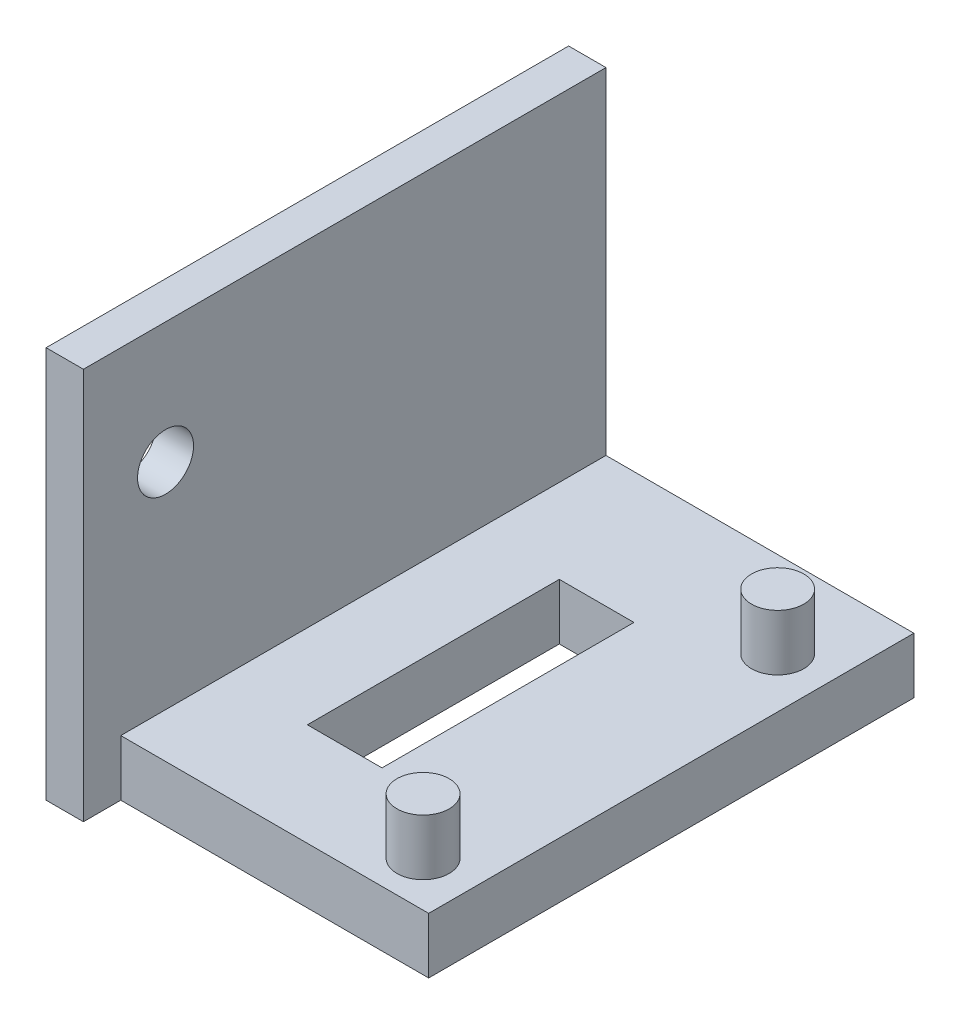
from build123d import *

# Parameters (mm, degrees)
SKETCH_5_W           = 16.5
SKETCH_5_H           = 26
SKETCH_5_W_2         = 4
SKETCH_5_H_2         = 13.5
EXTRUDE_1_DEPTH      = 3
SKETCH_7_R           = 1.4
EXTRUDE_2_DEPTH      = 3
EXTRUDE_3_DEPTH      = 18
EXTRUDE_3_DEPTH_BACK = 3
SKETCH_6_W           = 2
SKETCH_6_H           = 28
SKETCH_8_R           = 1.5
CUT_EXTRUDE_1_DEPTH  = 18


with BuildPart() as part:
    # Sketch 5 → Extrude 1 (new body)
    with BuildSketch(Plane(origin=(0, 0, 0), x_dir=(1, 0, 0), z_dir=(0, 1, 0))):
        Rectangle(SKETCH_5_W, SKETCH_5_H)
        with Locations((-1.75, -0.75)):
            Rectangle(SKETCH_5_W_2, SKETCH_5_H_2, mode=Mode.SUBTRACT)
    extrude(amount=-EXTRUDE_1_DEPTH)

    # Sketch 7 → Extrude 2 (add)
    with BuildSketch(Plane(origin=(0, 0, 0), x_dir=(1, 0, 0), z_dir=(0, 1, 0))):
        with Locations(Location((5.55, 8.4, 0), (0, 0, 270))):
            Circle(SKETCH_7_R)
        with Locations(Location((5.55, -10.6, 0), (0, 0, 270))):
            Circle(SKETCH_7_R)
    extrude(amount=EXTRUDE_2_DEPTH)

    # Sketch 6 → Extrude 3 (add, two sides: drawn at the far end of the back side and taken through both)
    with BuildSketch(Plane(origin=(0, 0, 0), x_dir=(1, 0, 0), z_dir=(0, 1, 0)).offset(-EXTRUDE_3_DEPTH_BACK)):
        with Locations((-9.25, -1)):
            Rectangle(SKETCH_6_W, SKETCH_6_H)
    extrude(amount=EXTRUDE_3_DEPTH + EXTRUDE_3_DEPTH_BACK)

    # Sketch 8 → Cut-Extrude 1 (cut)
    with BuildSketch(Plane(origin=(0, 0, 0), x_dir=(0, 0, -1), z_dir=(1, 0, 0))):
        with Locations((-10.6, 11.5)):
            Circle(SKETCH_8_R)
    extrude(amount=-CUT_EXTRUDE_1_DEPTH, mode=Mode.SUBTRACT)


solid = part.part
